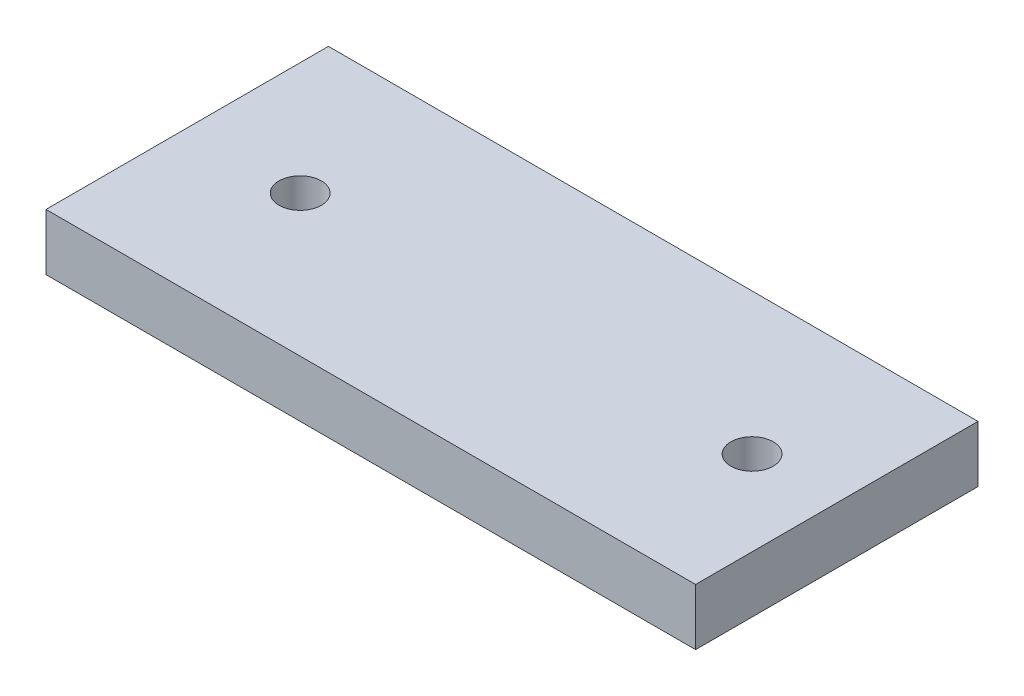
ISO-10303-21;
HEADER;
FILE_DESCRIPTION(('STEP AP214'),'2;1');
FILE_NAME('part.step','',(''),(''),'','','');
FILE_SCHEMA(('AUTOMOTIVE_DESIGN { 1 0 10303 214 1 1 1 1 }'));
ENDSEC;
DATA;
#1=APPLICATION_CONTEXT('core data for automotive mechanical design processes');
#2=APPLICATION_PROTOCOL_DEFINITION('international standard','automotive_design',2000,#1);
#3=PRODUCT_CONTEXT('',#1,'mechanical');
#4=PRODUCT('Part','Part','',(#3));
#5=PRODUCT_RELATED_PRODUCT_CATEGORY('part','',(#4));
#6=PRODUCT_DEFINITION_FORMATION('','',#4);
#7=PRODUCT_DEFINITION_CONTEXT('part definition',#1,'design');
#8=PRODUCT_DEFINITION('design','',#6,#7);
#9=PRODUCT_DEFINITION_SHAPE('','',#8);
#10=(LENGTH_UNIT() NAMED_UNIT(*) SI_UNIT(.MILLI.,.METRE.));
#11=(NAMED_UNIT(*) PLANE_ANGLE_UNIT() SI_UNIT($,.RADIAN.));
#12=(NAMED_UNIT(*) SI_UNIT($,.STERADIAN.) SOLID_ANGLE_UNIT());
#13=UNCERTAINTY_MEASURE_WITH_UNIT(LENGTH_MEASURE(1.E-05),#10,'distance_accuracy_value','');
#14=(GEOMETRIC_REPRESENTATION_CONTEXT(3) GLOBAL_UNCERTAINTY_ASSIGNED_CONTEXT((#13)) GLOBAL_UNIT_ASSIGNED_CONTEXT((#10,
#11,#12)) REPRESENTATION_CONTEXT('',''));
#15=CARTESIAN_POINT('',(0.,0.,0.));
#16=DIRECTION('',(0.,0.,1.));
#17=DIRECTION('',(1.,0.,0.));
#18=AXIS2_PLACEMENT_3D('',#15,#16,#17);
#19=CARTESIAN_POINT('',(69.85,12.7,-31.75));
#20=DIRECTION('',(0.,-1.,0.));
#21=DIRECTION('',(0.,0.,-1.));
#22=AXIS2_PLACEMENT_3D('',#19,#20,#21);
#23=PLANE('',#22);
#24=CARTESIAN_POINT('',(50.8,12.7,0.));
#25=DIRECTION('',(0.,1.,0.));
#26=DIRECTION('',(0.,0.,1.));
#27=AXIS2_PLACEMENT_3D('',#24,#25,#26);
#28=CIRCLE('',#27,4.7625);
#29=CARTESIAN_POINT('',(50.8,12.7,4.7625));
#30=VERTEX_POINT('',#29);
#31=EDGE_CURVE('E85',#30,#30,#28,.T.);
#32=ORIENTED_EDGE('',*,*,#31,.F.);
#33=EDGE_LOOP('',(#32));
#34=FACE_BOUND('',#33,.T.);
#35=DIRECTION('',(0.,0.,-1.));
#36=VECTOR('',#35,1.);
#37=CARTESIAN_POINT('',(69.85,12.7,-31.75));
#38=LINE('',#37,#36);
#39=CARTESIAN_POINT('',(69.85,12.7,31.75));
#40=VERTEX_POINT('',#39);
#41=CARTESIAN_POINT('',(69.85,12.7,-31.75));
#42=VERTEX_POINT('',#41);
#43=EDGE_CURVE('E95',#40,#42,#38,.T.);
#44=ORIENTED_EDGE('',*,*,#43,.T.);
#45=DIRECTION('',(-1.,0.,0.));
#46=VECTOR('',#45,1.);
#47=CARTESIAN_POINT('',(69.85,12.7,-31.75));
#48=LINE('',#47,#46);
#49=CARTESIAN_POINT('',(-76.2,12.7,-31.75));
#50=VERTEX_POINT('',#49);
#51=EDGE_CURVE('E80',#42,#50,#48,.T.);
#52=ORIENTED_EDGE('',*,*,#51,.T.);
#53=DIRECTION('',(0.,0.,1.));
#54=VECTOR('',#53,1.);
#55=CARTESIAN_POINT('',(-76.2,12.7,-31.75));
#56=LINE('',#55,#54);
#57=CARTESIAN_POINT('',(-76.2,12.7,31.75));
#58=VERTEX_POINT('',#57);
#59=EDGE_CURVE('E46',#50,#58,#56,.T.);
#60=ORIENTED_EDGE('',*,*,#59,.T.);
#61=DIRECTION('',(1.,0.,0.));
#62=VECTOR('',#61,1.);
#63=CARTESIAN_POINT('',(69.85,12.7,31.75));
#64=LINE('',#63,#62);
#65=EDGE_CURVE('E41',#58,#40,#64,.T.);
#66=ORIENTED_EDGE('',*,*,#65,.T.);
#67=EDGE_LOOP('',(#44,#52,#60,#66));
#68=FACE_BOUND('',#67,.T.);
#69=CARTESIAN_POINT('',(-50.8,12.7,0.));
#70=DIRECTION('',(0.,1.,0.));
#71=DIRECTION('',(0.,0.,1.));
#72=AXIS2_PLACEMENT_3D('',#69,#70,#71);
#73=CIRCLE('',#72,4.7625);
#74=CARTESIAN_POINT('',(-50.8,12.7,4.76250000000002));
#75=VERTEX_POINT('',#74);
#76=EDGE_CURVE('E113',#75,#75,#73,.T.);
#77=ORIENTED_EDGE('',*,*,#76,.F.);
#78=EDGE_LOOP('',(#77));
#79=FACE_BOUND('',#78,.T.);
#80=ADVANCED_FACE('F26',(#34,#68,#79),#23,.F.);
#81=CARTESIAN_POINT('',(69.85,0.,-31.75));
#82=DIRECTION('',(0.,-1.,0.));
#83=DIRECTION('',(0.,0.,-1.));
#84=AXIS2_PLACEMENT_3D('',#81,#82,#83);
#85=PLANE('',#84);
#86=CARTESIAN_POINT('',(50.8,0.,0.));
#87=DIRECTION('',(0.,1.,0.));
#88=DIRECTION('',(0.,0.,1.));
#89=AXIS2_PLACEMENT_3D('',#86,#87,#88);
#90=CIRCLE('',#89,4.7625);
#91=CARTESIAN_POINT('',(50.8,0.,4.7625));
#92=VERTEX_POINT('',#91);
#93=EDGE_CURVE('E88',#92,#92,#90,.T.);
#94=ORIENTED_EDGE('',*,*,#93,.T.);
#95=EDGE_LOOP('',(#94));
#96=FACE_BOUND('',#95,.T.);
#97=DIRECTION('',(0.,0.,-1.));
#98=VECTOR('',#97,1.);
#99=CARTESIAN_POINT('',(69.85,0.,-31.75));
#100=LINE('',#99,#98);
#101=CARTESIAN_POINT('',(69.85,0.,31.75));
#102=VERTEX_POINT('',#101);
#103=CARTESIAN_POINT('',(69.85,0.,-31.75));
#104=VERTEX_POINT('',#103);
#105=EDGE_CURVE('E72',#102,#104,#100,.T.);
#106=ORIENTED_EDGE('',*,*,#105,.F.);
#107=DIRECTION('',(1.,0.,0.));
#108=VECTOR('',#107,1.);
#109=CARTESIAN_POINT('',(69.85,0.,31.75));
#110=LINE('',#109,#108);
#111=CARTESIAN_POINT('',(-76.2,0.,31.75));
#112=VERTEX_POINT('',#111);
#113=EDGE_CURVE('E93',#112,#102,#110,.T.);
#114=ORIENTED_EDGE('',*,*,#113,.F.);
#115=DIRECTION('',(0.,0.,1.));
#116=VECTOR('',#115,1.);
#117=CARTESIAN_POINT('',(-76.2,0.,-31.75));
#118=LINE('',#117,#116);
#119=CARTESIAN_POINT('',(-76.2,0.,-31.75));
#120=VERTEX_POINT('',#119);
#121=EDGE_CURVE('E73',#120,#112,#118,.T.);
#122=ORIENTED_EDGE('',*,*,#121,.F.);
#123=DIRECTION('',(-1.,0.,0.));
#124=VECTOR('',#123,1.);
#125=CARTESIAN_POINT('',(69.85,0.,-31.75));
#126=LINE('',#125,#124);
#127=EDGE_CURVE('E67',#104,#120,#126,.T.);
#128=ORIENTED_EDGE('',*,*,#127,.F.);
#129=EDGE_LOOP('',(#106,#114,#122,#128));
#130=FACE_BOUND('',#129,.T.);
#131=CARTESIAN_POINT('',(-50.8,0.,0.));
#132=DIRECTION('',(0.,1.,0.));
#133=DIRECTION('',(0.,0.,1.));
#134=AXIS2_PLACEMENT_3D('',#131,#132,#133);
#135=CIRCLE('',#134,4.7625);
#136=CARTESIAN_POINT('',(-50.8,0.,4.76250000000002));
#137=VERTEX_POINT('',#136);
#138=EDGE_CURVE('E115',#137,#137,#135,.T.);
#139=ORIENTED_EDGE('',*,*,#138,.T.);
#140=EDGE_LOOP('',(#139));
#141=FACE_BOUND('',#140,.T.);
#142=ADVANCED_FACE('F68',(#96,#130,#141),#85,.T.);
#143=CARTESIAN_POINT('',(69.85,12.7,-31.75));
#144=DIRECTION('',(-1.,0.,0.));
#145=DIRECTION('',(0.,0.,1.));
#146=AXIS2_PLACEMENT_3D('',#143,#144,#145);
#147=PLANE('',#146);
#148=ORIENTED_EDGE('',*,*,#105,.T.);
#149=DIRECTION('',(0.,-1.,0.));
#150=VECTOR('',#149,1.);
#151=CARTESIAN_POINT('',(69.85,12.7,-31.75));
#152=LINE('',#151,#150);
#153=EDGE_CURVE('E11',#42,#104,#152,.T.);
#154=ORIENTED_EDGE('',*,*,#153,.F.);
#155=ORIENTED_EDGE('',*,*,#43,.F.);
#156=DIRECTION('',(0.,-1.,0.));
#157=VECTOR('',#156,1.);
#158=CARTESIAN_POINT('',(69.85,12.7,31.75));
#159=LINE('',#158,#157);
#160=EDGE_CURVE('E84',#40,#102,#159,.T.);
#161=ORIENTED_EDGE('',*,*,#160,.T.);
#162=EDGE_LOOP('',(#148,#154,#155,#161));
#163=FACE_BOUND('',#162,.T.);
#164=ADVANCED_FACE('F28',(#163),#147,.F.);
#165=CARTESIAN_POINT('',(69.85,12.7,-31.75));
#166=DIRECTION('',(0.,0.,1.));
#167=DIRECTION('',(1.,0.,0.));
#168=AXIS2_PLACEMENT_3D('',#165,#166,#167);
#169=PLANE('',#168);
#170=ORIENTED_EDGE('',*,*,#127,.T.);
#171=DIRECTION('',(0.,-1.,0.));
#172=VECTOR('',#171,1.);
#173=CARTESIAN_POINT('',(-76.2,12.7,-31.75));
#174=LINE('',#173,#172);
#175=EDGE_CURVE('E34',#50,#120,#174,.T.);
#176=ORIENTED_EDGE('',*,*,#175,.F.);
#177=ORIENTED_EDGE('',*,*,#51,.F.);
#178=ORIENTED_EDGE('',*,*,#153,.T.);
#179=EDGE_LOOP('',(#170,#176,#177,#178));
#180=FACE_BOUND('',#179,.T.);
#181=ADVANCED_FACE('F79',(#180),#169,.F.);
#182=CARTESIAN_POINT('',(-76.2,12.7,-31.75));
#183=DIRECTION('',(1.,0.,0.));
#184=DIRECTION('',(0.,0.,-1.));
#185=AXIS2_PLACEMENT_3D('',#182,#183,#184);
#186=PLANE('',#185);
#187=ORIENTED_EDGE('',*,*,#121,.T.);
#188=DIRECTION('',(0.,-1.,0.));
#189=VECTOR('',#188,1.);
#190=CARTESIAN_POINT('',(-76.2,12.7,31.75));
#191=LINE('',#190,#189);
#192=EDGE_CURVE('E101',#58,#112,#191,.T.);
#193=ORIENTED_EDGE('',*,*,#192,.F.);
#194=ORIENTED_EDGE('',*,*,#59,.F.);
#195=ORIENTED_EDGE('',*,*,#175,.T.);
#196=EDGE_LOOP('',(#187,#193,#194,#195));
#197=FACE_BOUND('',#196,.T.);
#198=ADVANCED_FACE('F104',(#197),#186,.F.);
#199=CARTESIAN_POINT('',(69.85,12.7,31.75));
#200=DIRECTION('',(0.,0.,-1.));
#201=DIRECTION('',(-1.,0.,0.));
#202=AXIS2_PLACEMENT_3D('',#199,#200,#201);
#203=PLANE('',#202);
#204=ORIENTED_EDGE('',*,*,#113,.T.);
#205=ORIENTED_EDGE('',*,*,#160,.F.);
#206=ORIENTED_EDGE('',*,*,#65,.F.);
#207=ORIENTED_EDGE('',*,*,#192,.T.);
#208=EDGE_LOOP('',(#204,#205,#206,#207));
#209=FACE_BOUND('',#208,.T.);
#210=ADVANCED_FACE('F106',(#209),#203,.F.);
#211=CARTESIAN_POINT('',(50.8,12.7,0.));
#212=DIRECTION('',(0.,-1.,0.));
#213=DIRECTION('',(0.,0.,-1.));
#214=AXIS2_PLACEMENT_3D('',#211,#212,#213);
#215=CYLINDRICAL_SURFACE('',#214,4.7625);
#216=ORIENTED_EDGE('',*,*,#31,.T.);
#217=EDGE_LOOP('',(#216));
#218=FACE_BOUND('',#217,.T.);
#219=ORIENTED_EDGE('',*,*,#93,.F.);
#220=EDGE_LOOP('',(#219));
#221=FACE_BOUND('',#220,.T.);
#222=ADVANCED_FACE('F124',(#218,#221),#215,.F.);
#223=CARTESIAN_POINT('',(-50.8,12.7,0.));
#224=DIRECTION('',(0.,-1.,0.));
#225=DIRECTION('',(0.,0.,-1.));
#226=AXIS2_PLACEMENT_3D('',#223,#224,#225);
#227=CYLINDRICAL_SURFACE('',#226,4.7625);
#228=ORIENTED_EDGE('',*,*,#76,.T.);
#229=EDGE_LOOP('',(#228));
#230=FACE_BOUND('',#229,.T.);
#231=ORIENTED_EDGE('',*,*,#138,.F.);
#232=EDGE_LOOP('',(#231));
#233=FACE_BOUND('',#232,.T.);
#234=ADVANCED_FACE('F122',(#230,#233),#227,.F.);
#235=CLOSED_SHELL('',(#80,#142,#164,#181,#198,#210,#222,#234));
#236=MANIFOLD_SOLID_BREP('B2',#235);
#237=ADVANCED_BREP_SHAPE_REPRESENTATION('',(#18,#236),#14);
#238=SHAPE_DEFINITION_REPRESENTATION(#9,#237);
ENDSEC;
END-ISO-10303-21;
